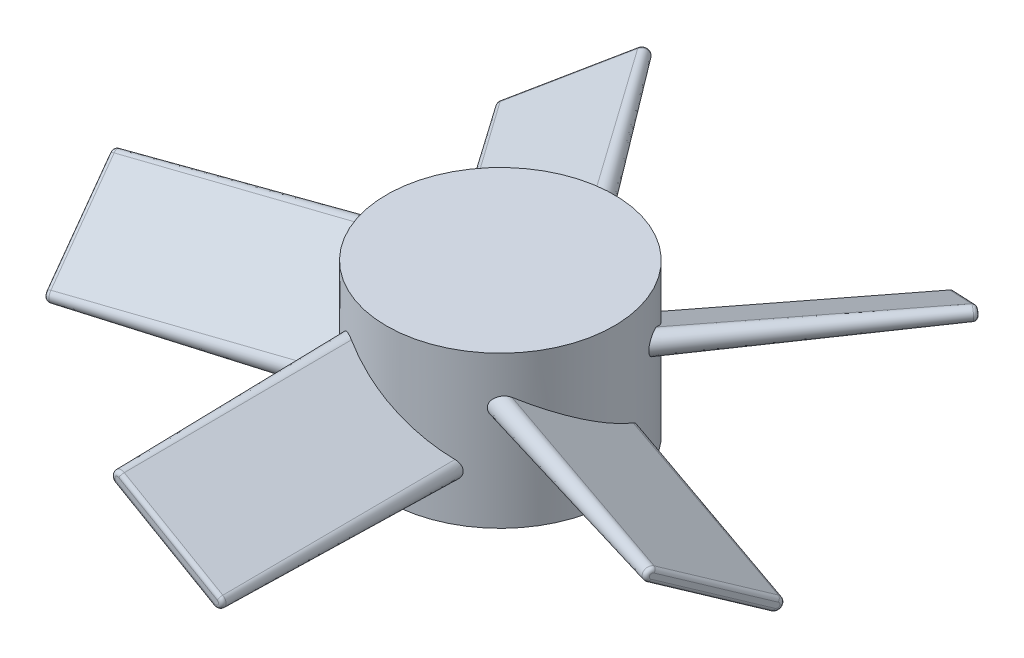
from build123d import *

# Parameters (mm, degrees)
SKETCH1_R                = 38.1
BOSS_EXTRUDE1_DEPTH      = 50.8
BOSS_EXTRUDE2_DEPTH      = 111.76
BOSS_EXTRUDE2_TAPER      = 1
FILLET1_R                = 1.27
CIRPATTERN1_COUNT        = 5
FILLET1_OF_CIRPATTERN1_R = 1.27


with BuildPart() as part:
    # Sketch1 → Boss-Extrude1 (new body)
    with BuildSketch(Plane(origin=(0, 0, 0), x_dir=(1, 0, 0), z_dir=(0, 1, 0))):
        with Locations(Location((0, 0, 0), (0, 0, 270))):
            Circle(SKETCH1_R)
    extrude(amount=BOSS_EXTRUDE1_DEPTH)

    # Sketch2 → Boss-Extrude2 (add)
    with BuildSketch(Plane.XY):
        with BuildLine():
            ThreePointArc((-14.465783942, 38.444527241), (-20.017311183, 36.957), (-18.529783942, 31.405472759))
            Line((-18.529783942, 31.405472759), (14.465783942, 12.355472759))
            ThreePointArc((14.465783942, 12.355472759), (20.017311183, 13.843), (18.529783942, 19.394527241))
            Line((18.529783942, 19.394527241), (-14.465783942, 38.444527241))
        make_face()
    boss_extrude2 = extrude(amount=BOSS_EXTRUDE2_DEPTH, taper=BOSS_EXTRUDE2_TAPER)

    # Fillet1
    fillet1_edges = [part.edges().sort_by_distance(p)[0] for p in [
        (-1.056610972, 23.569896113, 111.76),
        (18.327887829, 14.818389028, 111.76),
        (1.056610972, 27.230103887, 111.76),
        (-18.327887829, 35.981610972, 111.76),
    ]]
    fillet(fillet1_edges, radius=FILLET1_R)

    # CirPattern1: Boss-Extrude2 ×5 about axis
    cirpattern1_axis = Axis((0, 0, 0), (0, 1, 0))
    for i in range(1, CIRPATTERN1_COUNT):
        add(boss_extrude2.rotate(cirpattern1_axis, i * 360 / CIRPATTERN1_COUNT))

    # Fillet1 of CirPattern1
    fillet1_of_cirpattern1_edges = [part.edges().sort_by_distance(p)[0] for p in [
        (105.963565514, 23.569896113, 35.540636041),
        (111.953705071, 14.818389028, 17.104882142),
        (106.616587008, 27.230103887, 33.530842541),
        (100.626447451, 35.981610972, 51.966596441),
        (66.545696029, 23.569896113, -89.794678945),
        (50.863307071, 14.818389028, -101.188601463),
        (64.836063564, 27.230103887, -91.036799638),
        (80.518452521, 35.981610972, -79.64287712),
        (-64.836063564, 23.569896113, -91.036799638),
        (-80.518452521, 14.818389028, -79.64287712),
        (-66.545696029, 27.230103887, -89.794678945),
        (-50.863307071, 35.981610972, -101.188601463),
        (-106.616587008, 23.569896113, 33.530842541),
        (-100.626447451, 14.818389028, 51.966596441),
        (-105.963565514, 27.230103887, 35.540636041),
        (-111.953705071, 35.981610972, 17.104882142),
    ]]
    fillet(fillet1_of_cirpattern1_edges, radius=FILLET1_OF_CIRPATTERN1_R)


solid = part.part
